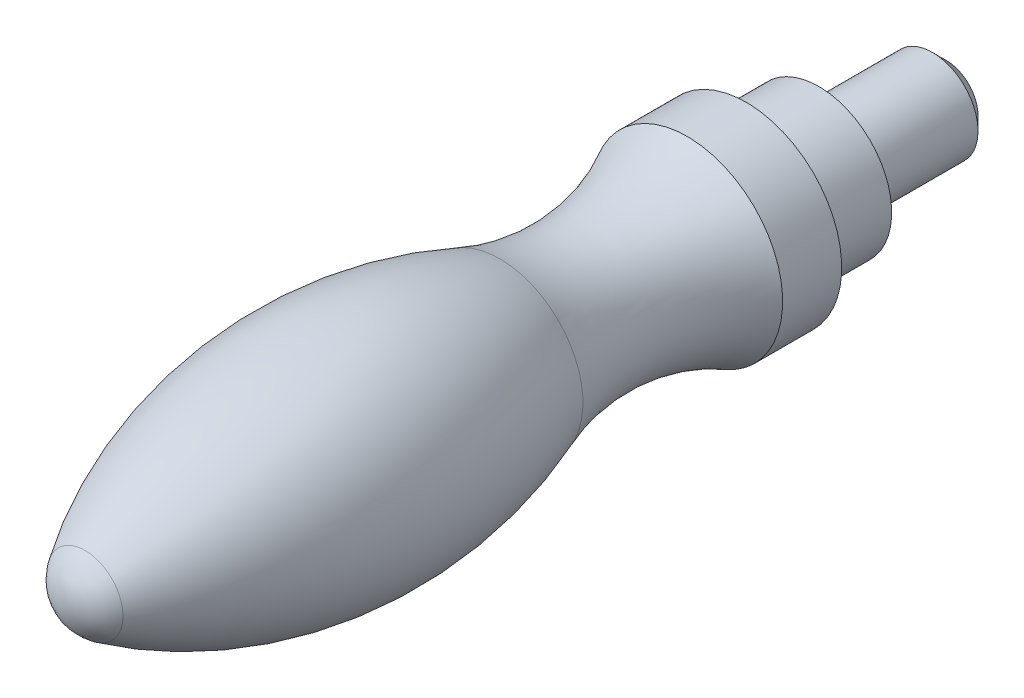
ISO-10303-21;
HEADER;
FILE_DESCRIPTION(('STEP AP214'),'2;1');
FILE_NAME('part.step','',(''),(''),'','','');
FILE_SCHEMA(('AUTOMOTIVE_DESIGN { 1 0 10303 214 1 1 1 1 }'));
ENDSEC;
DATA;
#1=APPLICATION_CONTEXT('core data for automotive mechanical design processes');
#2=APPLICATION_PROTOCOL_DEFINITION('international standard','automotive_design',2000,#1);
#3=PRODUCT_CONTEXT('',#1,'mechanical');
#4=PRODUCT('Part','Part','',(#3));
#5=PRODUCT_RELATED_PRODUCT_CATEGORY('part','',(#4));
#6=PRODUCT_DEFINITION_FORMATION('','',#4);
#7=PRODUCT_DEFINITION_CONTEXT('part definition',#1,'design');
#8=PRODUCT_DEFINITION('design','',#6,#7);
#9=PRODUCT_DEFINITION_SHAPE('','',#8);
#10=(LENGTH_UNIT() NAMED_UNIT(*) SI_UNIT(.MILLI.,.METRE.));
#11=(NAMED_UNIT(*) PLANE_ANGLE_UNIT() SI_UNIT($,.RADIAN.));
#12=(NAMED_UNIT(*) SI_UNIT($,.STERADIAN.) SOLID_ANGLE_UNIT());
#13=UNCERTAINTY_MEASURE_WITH_UNIT(LENGTH_MEASURE(1.E-05),#10,'distance_accuracy_value','');
#14=(GEOMETRIC_REPRESENTATION_CONTEXT(3) GLOBAL_UNCERTAINTY_ASSIGNED_CONTEXT((#13)) GLOBAL_UNIT_ASSIGNED_CONTEXT((#10,
#11,#12)) REPRESENTATION_CONTEXT('',''));
#15=CARTESIAN_POINT('',(0.,0.,0.));
#16=DIRECTION('',(0.,0.,1.));
#17=DIRECTION('',(1.,0.,0.));
#18=AXIS2_PLACEMENT_3D('',#15,#16,#17);
#19=CARTESIAN_POINT('',(1.11088884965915E-05,0.,77.9999940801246));
#20=DIRECTION('',(0.,-1.,0.));
#21=DIRECTION('',(-1.,0.,0.));
#22=AXIS2_PLACEMENT_3D('',#19,#20,#21);
#23=CIRCLE('',#22,5.00000591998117);
#24=TRIMMED_CURVE('',#23,(PARAMETER_VALUE(-1.57079410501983)),
(PARAMETER_VALUE(1.57079410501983)),.T.,.PARAMETER.);
#25=CARTESIAN_POINT('',(0.,0.,77.9999940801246));
#26=DIRECTION('',(0.,0.,-1.));
#27=AXIS1_PLACEMENT('',#25,#26);
#28=SURFACE_OF_REVOLUTION('',#24,#27);
#29=CARTESIAN_POINT('',(0.,0.,80.7638514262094));
#30=DIRECTION('',(0.,0.,-1.));
#31=DIRECTION('',(-1.,0.,0.));
#32=AXIS2_PLACEMENT_3D('',#29,#30,#31);
#33=CIRCLE('',#32,4.16666043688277);
#34=CARTESIAN_POINT('',(-4.16666043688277,0.,80.7638514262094));
#35=VERTEX_POINT('',#34);
#36=EDGE_CURVE('E9',#35,#35,#33,.T.);
#37=ORIENTED_EDGE('',*,*,#36,.F.);
#38=EDGE_LOOP('',(#37));
#39=FACE_BOUND('',#38,.T.);
#40=CARTESIAN_POINT('',(0.,0.,83.0000000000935));
#41=VERTEX_POINT('',#40);
#42=VERTEX_LOOP('',#41);
#43=FACE_BOUND('',#42,.T.);
#44=ADVANCED_FACE('F14',(#39,#43),#28,.T.);
#45=CARTESIAN_POINT('',(0.,0.,53.1253149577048));
#46=DIRECTION('',(0.,0.,-1.));
#47=DIRECTION('',(-1.,0.,0.));
#48=AXIS2_PLACEMENT_3D('',#45,#46,#47);
#49=DEGENERATE_TOROIDAL_SURFACE('',#48,37.4999992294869,49.9999922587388,.F.);
#50=CARTESIAN_POINT('',(0.,0.,35.1286580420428));
#51=DIRECTION('',(0.,0.,-1.));
#52=DIRECTION('',(-1.,0.,0.));
#53=AXIS2_PLACEMENT_3D('',#50,#51,#52);
#54=CIRCLE('',#53,9.14889749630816);
#55=CARTESIAN_POINT('',(-9.14889749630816,0.,35.1286580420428));
#56=VERTEX_POINT('',#55);
#57=EDGE_CURVE('E21',#56,#56,#54,.T.);
#58=ORIENTED_EDGE('',*,*,#57,.F.);
#59=EDGE_LOOP('',(#58));
#60=FACE_BOUND('',#59,.T.);
#61=ORIENTED_EDGE('',*,*,#36,.T.);
#62=EDGE_LOOP('',(#61));
#63=FACE_BOUND('',#62,.T.);
#64=ADVANCED_FACE('F145',(#60,#63),#49,.F.);
#65=CARTESIAN_POINT('',(0.,0.,26.2734557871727));
#66=DIRECTION('',(0.,0.,-1.));
#67=DIRECTION('',(-1.,0.,0.));
#68=AXIS2_PLACEMENT_3D('',#65,#66,#67);
#69=TOROIDAL_SURFACE('',#68,32.1023503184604,24.6023495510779);
#70=CARTESIAN_POINT('',(0.,0.,14.500006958));
#71=DIRECTION('',(0.,0.,-1.));
#72=DIRECTION('',(-1.,0.,0.));
#73=AXIS2_PLACEMENT_3D('',#70,#71,#72);
#74=CIRCLE('',#73,10.500000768);
#75=CARTESIAN_POINT('',(-10.500000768,0.,14.500006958));
#76=VERTEX_POINT('',#75);
#77=EDGE_CURVE('E138',#76,#76,#74,.T.);
#78=ORIENTED_EDGE('',*,*,#77,.F.);
#79=EDGE_LOOP('',(#78));
#80=FACE_BOUND('',#79,.T.);
#81=ORIENTED_EDGE('',*,*,#57,.T.);
#82=EDGE_LOOP('',(#81));
#83=FACE_BOUND('',#82,.T.);
#84=ADVANCED_FACE('F143',(#80,#83),#69,.F.);
#85=CARTESIAN_POINT('',(0.,0.,-29.8522019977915));
#86=DIRECTION('',(0.,0.,-1.));
#87=DIRECTION('',(-1.,0.,0.));
#88=AXIS2_PLACEMENT_3D('',#85,#86,#87);
#89=CYLINDRICAL_SURFACE('',#88,10.500000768);
#90=CARTESIAN_POINT('',(0.,0.,8.000001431));
#91=DIRECTION('',(0.,0.,-1.));
#92=DIRECTION('',(-1.,0.,0.));
#93=AXIS2_PLACEMENT_3D('',#90,#91,#92);
#94=CIRCLE('',#93,10.500000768);
#95=CARTESIAN_POINT('',(-10.500000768,0.,8.000001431));
#96=VERTEX_POINT('',#95);
#97=EDGE_CURVE('E135',#96,#96,#94,.T.);
#98=ORIENTED_EDGE('',*,*,#97,.F.);
#99=EDGE_LOOP('',(#98));
#100=FACE_BOUND('',#99,.T.);
#101=ORIENTED_EDGE('',*,*,#77,.T.);
#102=EDGE_LOOP('',(#101));
#103=FACE_BOUND('',#102,.T.);
#104=ADVANCED_FACE('F166',(#100,#103),#89,.T.);
#105=CARTESIAN_POINT('',(0.,10.500000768,8.000001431));
#106=DIRECTION('',(0.,0.,1.));
#107=DIRECTION('',(1.,0.,0.));
#108=AXIS2_PLACEMENT_3D('',#105,#106,#107);
#109=PLANE('',#108);
#110=CARTESIAN_POINT('',(0.,0.,8.000001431));
#111=DIRECTION('',(0.,0.,-1.));
#112=DIRECTION('',(-1.,0.,0.));
#113=AXIS2_PLACEMENT_3D('',#110,#111,#112);
#114=CIRCLE('',#113,8.);
#115=CARTESIAN_POINT('',(-8.,0.,8.000001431));
#116=VERTEX_POINT('',#115);
#117=EDGE_CURVE('E132',#116,#116,#114,.T.);
#118=ORIENTED_EDGE('',*,*,#117,.F.);
#119=EDGE_LOOP('',(#118));
#120=FACE_BOUND('',#119,.T.);
#121=ORIENTED_EDGE('',*,*,#97,.T.);
#122=EDGE_LOOP('',(#121));
#123=FACE_BOUND('',#122,.T.);
#124=ADVANCED_FACE('F174',(#120,#123),#109,.F.);
#125=CARTESIAN_POINT('',(0.,0.,-29.8522019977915));
#126=DIRECTION('',(0.,0.,-1.));
#127=DIRECTION('',(-1.,0.,0.));
#128=AXIS2_PLACEMENT_3D('',#125,#126,#127);
#129=CYLINDRICAL_SURFACE('',#128,8.);
#130=CARTESIAN_POINT('',(0.,0.,0.));
#131=DIRECTION('',(0.,0.,-1.));
#132=DIRECTION('',(-1.,0.,0.));
#133=AXIS2_PLACEMENT_3D('',#130,#131,#132);
#134=CIRCLE('',#133,8.);
#135=CARTESIAN_POINT('',(-8.,0.,0.));
#136=VERTEX_POINT('',#135);
#137=EDGE_CURVE('E129',#136,#136,#134,.T.);
#138=ORIENTED_EDGE('',*,*,#137,.F.);
#139=EDGE_LOOP('',(#138));
#140=FACE_BOUND('',#139,.T.);
#141=ORIENTED_EDGE('',*,*,#117,.T.);
#142=EDGE_LOOP('',(#141));
#143=FACE_BOUND('',#142,.T.);
#144=ADVANCED_FACE('F182',(#140,#143),#129,.T.);
#145=CARTESIAN_POINT('',(0.,8.,0.));
#146=DIRECTION('',(0.,0.,1.));
#147=DIRECTION('',(1.,0.,0.));
#148=AXIS2_PLACEMENT_3D('',#145,#146,#147);
#149=PLANE('',#148);
#150=CARTESIAN_POINT('',(0.,0.,0.));
#151=DIRECTION('',(0.,0.,-1.));
#152=DIRECTION('',(-1.,0.,0.));
#153=AXIS2_PLACEMENT_3D('',#150,#151,#152);
#154=CIRCLE('',#153,5.);
#155=CARTESIAN_POINT('',(-5.,0.,0.));
#156=VERTEX_POINT('',#155);
#157=EDGE_CURVE('E126',#156,#156,#154,.T.);
#158=ORIENTED_EDGE('',*,*,#157,.F.);
#159=EDGE_LOOP('',(#158));
#160=FACE_BOUND('',#159,.T.);
#161=ORIENTED_EDGE('',*,*,#137,.T.);
#162=EDGE_LOOP('',(#161));
#163=FACE_BOUND('',#162,.T.);
#164=ADVANCED_FACE('F190',(#160,#163),#149,.F.);
#165=CARTESIAN_POINT('',(0.,0.,-29.8522019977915));
#166=DIRECTION('',(0.,0.,-1.));
#167=DIRECTION('',(-1.,0.,0.));
#168=AXIS2_PLACEMENT_3D('',#165,#166,#167);
#169=CYLINDRICAL_SURFACE('',#168,5.);
#170=CARTESIAN_POINT('',(0.,0.,-12.5));
#171=DIRECTION('',(0.,0.,-1.));
#172=DIRECTION('',(-1.,0.,0.));
#173=AXIS2_PLACEMENT_3D('',#170,#171,#172);
#174=CIRCLE('',#173,5.);
#175=CARTESIAN_POINT('',(-5.,0.,-12.5));
#176=VERTEX_POINT('',#175);
#177=EDGE_CURVE('E123',#176,#176,#174,.T.);
#178=ORIENTED_EDGE('',*,*,#177,.F.);
#179=EDGE_LOOP('',(#178));
#180=FACE_BOUND('',#179,.T.);
#181=ORIENTED_EDGE('',*,*,#157,.T.);
#182=EDGE_LOOP('',(#181));
#183=FACE_BOUND('',#182,.T.);
#184=ADVANCED_FACE('F198',(#180,#183),#169,.T.);
#185=CARTESIAN_POINT('',(0.,0.,-12.5));
#186=DIRECTION('',(0.,0.,1.));
#187=DIRECTION('',(1.,0.,0.));
#188=AXIS2_PLACEMENT_3D('',#185,#186,#187);
#189=CONICAL_SURFACE('',#188,5.,0.785398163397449);
#190=CARTESIAN_POINT('',(0.,0.,-14.));
#191=DIRECTION('',(0.,0.,-1.));
#192=DIRECTION('',(-1.,0.,0.));
#193=AXIS2_PLACEMENT_3D('',#190,#191,#192);
#194=CIRCLE('',#193,3.5);
#195=CARTESIAN_POINT('',(-3.5,0.,-14.));
#196=VERTEX_POINT('',#195);
#197=EDGE_CURVE('E113',#196,#196,#194,.T.);
#198=ORIENTED_EDGE('',*,*,#197,.F.);
#199=EDGE_LOOP('',(#198));
#200=FACE_BOUND('',#199,.T.);
#201=ORIENTED_EDGE('',*,*,#177,.T.);
#202=EDGE_LOOP('',(#201));
#203=FACE_BOUND('',#202,.T.);
#204=ADVANCED_FACE('F206',(#200,#203),#189,.T.);
#205=CARTESIAN_POINT('',(0.,0.,-14.));
#206=DIRECTION('',(0.,0.,1.));
#207=DIRECTION('',(1.,0.,0.));
#208=AXIS2_PLACEMENT_3D('',#205,#206,#207);
#209=PLANE('',#208);
#210=DIRECTION('',(0.866025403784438,-0.5,0.));
#211=VECTOR('',#210,1.);
#212=CARTESIAN_POINT('',(0.,2.88675134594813,-14.));
#213=LINE('',#212,#211);
#214=CARTESIAN_POINT('',(0.,2.88675134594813,-14.));
#215=VERTEX_POINT('',#214);
#216=CARTESIAN_POINT('',(2.5,1.44337567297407,-14.));
#217=VERTEX_POINT('',#216);
#218=EDGE_CURVE('E101',#215,#217,#213,.T.);
#219=ORIENTED_EDGE('',*,*,#218,.F.);
#220=DIRECTION('',(0.866025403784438,0.5,0.));
#221=VECTOR('',#220,1.);
#222=CARTESIAN_POINT('',(-2.5,1.44337567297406,-14.));
#223=LINE('',#222,#221);
#224=CARTESIAN_POINT('',(-2.5,1.44337567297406,-14.));
#225=VERTEX_POINT('',#224);
#226=EDGE_CURVE('E28',#225,#215,#223,.T.);
#227=ORIENTED_EDGE('',*,*,#226,.F.);
#228=DIRECTION('',(0.,1.,0.));
#229=VECTOR('',#228,1.);
#230=CARTESIAN_POINT('',(-2.5,-1.44337567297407,-14.));
#231=LINE('',#230,#229);
#232=CARTESIAN_POINT('',(-2.5,-1.44337567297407,-14.));
#233=VERTEX_POINT('',#232);
#234=EDGE_CURVE('E87',#233,#225,#231,.T.);
#235=ORIENTED_EDGE('',*,*,#234,.F.);
#236=DIRECTION('',(-0.866025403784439,0.5,0.));
#237=VECTOR('',#236,1.);
#238=CARTESIAN_POINT('',(0.,-2.88675134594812,-14.));
#239=LINE('',#238,#237);
#240=CARTESIAN_POINT('',(0.,-2.88675134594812,-14.));
#241=VERTEX_POINT('',#240);
#242=EDGE_CURVE('E90',#241,#233,#239,.T.);
#243=ORIENTED_EDGE('',*,*,#242,.F.);
#244=DIRECTION('',(-0.866025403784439,-0.5,0.));
#245=VECTOR('',#244,1.);
#246=CARTESIAN_POINT('',(2.5,-1.44337567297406,-14.));
#247=LINE('',#246,#245);
#248=CARTESIAN_POINT('',(2.5,-1.44337567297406,-14.));
#249=VERTEX_POINT('',#248);
#250=EDGE_CURVE('E106',#249,#241,#247,.T.);
#251=ORIENTED_EDGE('',*,*,#250,.F.);
#252=DIRECTION('',(0.,-1.,0.));
#253=VECTOR('',#252,1.);
#254=CARTESIAN_POINT('',(2.5,1.44337567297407,-14.));
#255=LINE('',#254,#253);
#256=EDGE_CURVE('E103',#217,#249,#255,.T.);
#257=ORIENTED_EDGE('',*,*,#256,.F.);
#258=EDGE_LOOP('',(#219,#227,#235,#243,#251,#257));
#259=FACE_BOUND('',#258,.T.);
#260=ORIENTED_EDGE('',*,*,#197,.T.);
#261=EDGE_LOOP('',(#260));
#262=FACE_BOUND('',#261,.T.);
#263=ADVANCED_FACE('F214',(#259,#262),#209,.F.);
#264=CARTESIAN_POINT('',(-2.5,1.44337567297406,-10.));
#265=DIRECTION('',(-0.5,0.866025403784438,0.));
#266=DIRECTION('',(-0.866025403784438,-0.5,0.));
#267=AXIS2_PLACEMENT_3D('',#264,#265,#266);
#268=PLANE('',#267);
#269=ORIENTED_EDGE('',*,*,#226,.T.);
#270=DIRECTION('',(0.,0.,-1.));
#271=VECTOR('',#270,1.);
#272=CARTESIAN_POINT('',(0.,2.88675134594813,-10.));
#273=LINE('',#272,#271);
#274=CARTESIAN_POINT('',(0.,2.88675134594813,-10.));
#275=VERTEX_POINT('',#274);
#276=EDGE_CURVE('E64',#275,#215,#273,.T.);
#277=ORIENTED_EDGE('',*,*,#276,.F.);
#278=DIRECTION('',(0.866025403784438,0.5,0.));
#279=VECTOR('',#278,1.);
#280=CARTESIAN_POINT('',(-2.5,1.44337567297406,-10.));
#281=LINE('',#280,#279);
#282=CARTESIAN_POINT('',(-2.5,1.44337567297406,-10.));
#283=VERTEX_POINT('',#282);
#284=EDGE_CURVE('E68',#283,#275,#281,.T.);
#285=ORIENTED_EDGE('',*,*,#284,.F.);
#286=DIRECTION('',(0.,0.,-1.));
#287=VECTOR('',#286,1.);
#288=CARTESIAN_POINT('',(-2.5,1.44337567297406,-10.));
#289=LINE('',#288,#287);
#290=EDGE_CURVE('E111',#283,#225,#289,.T.);
#291=ORIENTED_EDGE('',*,*,#290,.T.);
#292=EDGE_LOOP('',(#269,#277,#285,#291));
#293=FACE_BOUND('',#292,.T.);
#294=ADVANCED_FACE('F66',(#293),#268,.F.);
#295=CARTESIAN_POINT('',(-2.5,-1.44337567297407,-10.));
#296=DIRECTION('',(-1.,0.,0.));
#297=DIRECTION('',(0.,-1.,0.));
#298=AXIS2_PLACEMENT_3D('',#295,#296,#297);
#299=PLANE('',#298);
#300=ORIENTED_EDGE('',*,*,#234,.T.);
#301=ORIENTED_EDGE('',*,*,#290,.F.);
#302=DIRECTION('',(0.,1.,0.));
#303=VECTOR('',#302,1.);
#304=CARTESIAN_POINT('',(-2.5,-1.44337567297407,-10.));
#305=LINE('',#304,#303);
#306=CARTESIAN_POINT('',(-2.5,-1.44337567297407,-10.));
#307=VERTEX_POINT('',#306);
#308=EDGE_CURVE('E74',#307,#283,#305,.T.);
#309=ORIENTED_EDGE('',*,*,#308,.F.);
#310=DIRECTION('',(0.,0.,-1.));
#311=VECTOR('',#310,1.);
#312=CARTESIAN_POINT('',(-2.5,-1.44337567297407,-10.));
#313=LINE('',#312,#311);
#314=EDGE_CURVE('E114',#307,#233,#313,.T.);
#315=ORIENTED_EDGE('',*,*,#314,.T.);
#316=EDGE_LOOP('',(#300,#301,#309,#315));
#317=FACE_BOUND('',#316,.T.);
#318=ADVANCED_FACE('F229',(#317),#299,.F.);
#319=CARTESIAN_POINT('',(0.,-2.88675134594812,-10.));
#320=DIRECTION('',(-0.5,-0.866025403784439,0.));
#321=DIRECTION('',(0.866025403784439,-0.5,0.));
#322=AXIS2_PLACEMENT_3D('',#319,#320,#321);
#323=PLANE('',#322);
#324=ORIENTED_EDGE('',*,*,#242,.T.);
#325=ORIENTED_EDGE('',*,*,#314,.F.);
#326=DIRECTION('',(-0.866025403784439,0.5,0.));
#327=VECTOR('',#326,1.);
#328=CARTESIAN_POINT('',(0.,-2.88675134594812,-10.));
#329=LINE('',#328,#327);
#330=CARTESIAN_POINT('',(0.,-2.88675134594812,-10.));
#331=VERTEX_POINT('',#330);
#332=EDGE_CURVE('E97',#331,#307,#329,.T.);
#333=ORIENTED_EDGE('',*,*,#332,.F.);
#334=DIRECTION('',(0.,0.,-1.));
#335=VECTOR('',#334,1.);
#336=CARTESIAN_POINT('',(0.,-2.88675134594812,-10.));
#337=LINE('',#336,#335);
#338=EDGE_CURVE('E116',#331,#241,#337,.T.);
#339=ORIENTED_EDGE('',*,*,#338,.T.);
#340=EDGE_LOOP('',(#324,#325,#333,#339));
#341=FACE_BOUND('',#340,.T.);
#342=ADVANCED_FACE('F236',(#341),#323,.F.);
#343=CARTESIAN_POINT('',(2.5,-1.44337567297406,-10.));
#344=DIRECTION('',(0.5,-0.866025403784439,0.));
#345=DIRECTION('',(0.866025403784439,0.5,0.));
#346=AXIS2_PLACEMENT_3D('',#343,#344,#345);
#347=PLANE('',#346);
#348=ORIENTED_EDGE('',*,*,#250,.T.);
#349=ORIENTED_EDGE('',*,*,#338,.F.);
#350=DIRECTION('',(-0.866025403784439,-0.5,0.));
#351=VECTOR('',#350,1.);
#352=CARTESIAN_POINT('',(2.5,-1.44337567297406,-10.));
#353=LINE('',#352,#351);
#354=CARTESIAN_POINT('',(2.5,-1.44337567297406,-10.));
#355=VERTEX_POINT('',#354);
#356=EDGE_CURVE('E94',#355,#331,#353,.T.);
#357=ORIENTED_EDGE('',*,*,#356,.F.);
#358=DIRECTION('',(0.,0.,-1.));
#359=VECTOR('',#358,1.);
#360=CARTESIAN_POINT('',(2.5,-1.44337567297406,-10.));
#361=LINE('',#360,#359);
#362=EDGE_CURVE('E118',#355,#249,#361,.T.);
#363=ORIENTED_EDGE('',*,*,#362,.T.);
#364=EDGE_LOOP('',(#348,#349,#357,#363));
#365=FACE_BOUND('',#364,.T.);
#366=ADVANCED_FACE('F244',(#365),#347,.F.);
#367=CARTESIAN_POINT('',(2.5,1.44337567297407,-10.));
#368=DIRECTION('',(1.,0.,0.));
#369=DIRECTION('',(0.,0.,-1.));
#370=AXIS2_PLACEMENT_3D('',#367,#368,#369);
#371=PLANE('',#370);
#372=ORIENTED_EDGE('',*,*,#256,.T.);
#373=ORIENTED_EDGE('',*,*,#362,.F.);
#374=DIRECTION('',(0.,-1.,0.));
#375=VECTOR('',#374,1.);
#376=CARTESIAN_POINT('',(2.5,1.44337567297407,-10.));
#377=LINE('',#376,#375);
#378=CARTESIAN_POINT('',(2.5,1.44337567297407,-10.));
#379=VERTEX_POINT('',#378);
#380=EDGE_CURVE('E82',#379,#355,#377,.T.);
#381=ORIENTED_EDGE('',*,*,#380,.F.);
#382=DIRECTION('',(0.,0.,-1.));
#383=VECTOR('',#382,1.);
#384=CARTESIAN_POINT('',(2.5,1.44337567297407,-10.));
#385=LINE('',#384,#383);
#386=EDGE_CURVE('E73',#379,#217,#385,.T.);
#387=ORIENTED_EDGE('',*,*,#386,.T.);
#388=EDGE_LOOP('',(#372,#373,#381,#387));
#389=FACE_BOUND('',#388,.T.);
#390=ADVANCED_FACE('F252',(#389),#371,.F.);
#391=CARTESIAN_POINT('',(0.,2.88675134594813,-10.));
#392=DIRECTION('',(0.5,0.866025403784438,0.));
#393=DIRECTION('',(-0.866025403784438,0.5,0.));
#394=AXIS2_PLACEMENT_3D('',#391,#392,#393);
#395=PLANE('',#394);
#396=ORIENTED_EDGE('',*,*,#218,.T.);
#397=ORIENTED_EDGE('',*,*,#386,.F.);
#398=DIRECTION('',(0.866025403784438,-0.5,0.));
#399=VECTOR('',#398,1.);
#400=CARTESIAN_POINT('',(0.,2.88675134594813,-10.));
#401=LINE('',#400,#399);
#402=EDGE_CURVE('E77',#275,#379,#401,.T.);
#403=ORIENTED_EDGE('',*,*,#402,.F.);
#404=ORIENTED_EDGE('',*,*,#276,.T.);
#405=EDGE_LOOP('',(#396,#397,#403,#404));
#406=FACE_BOUND('',#405,.T.);
#407=ADVANCED_FACE('F78',(#406),#395,.F.);
#408=CARTESIAN_POINT('',(0.,-39.2054241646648,-10.));
#409=DIRECTION('',(0.,0.,-1.));
#410=DIRECTION('',(-1.,0.,0.));
#411=AXIS2_PLACEMENT_3D('',#408,#409,#410);
#412=PLANE('',#411);
#413=ORIENTED_EDGE('',*,*,#284,.T.);
#414=ORIENTED_EDGE('',*,*,#402,.T.);
#415=ORIENTED_EDGE('',*,*,#380,.T.);
#416=ORIENTED_EDGE('',*,*,#356,.T.);
#417=ORIENTED_EDGE('',*,*,#332,.T.);
#418=ORIENTED_EDGE('',*,*,#308,.T.);
#419=EDGE_LOOP('',(#413,#414,#415,#416,#417,#418));
#420=FACE_BOUND('',#419,.T.);
#421=ADVANCED_FACE('F84',(#420),#412,.T.);
#422=CLOSED_SHELL('',(#44,#64,#84,#104,#124,#144,#164,#184,#204,#263,#294,#318,#342,#366,#390,
#407,#421));
#423=MANIFOLD_SOLID_BREP('B1',#422);
#424=ADVANCED_BREP_SHAPE_REPRESENTATION('',(#18,#423),#14);
#425=SHAPE_DEFINITION_REPRESENTATION(#9,#424);
ENDSEC;
END-ISO-10303-21;
